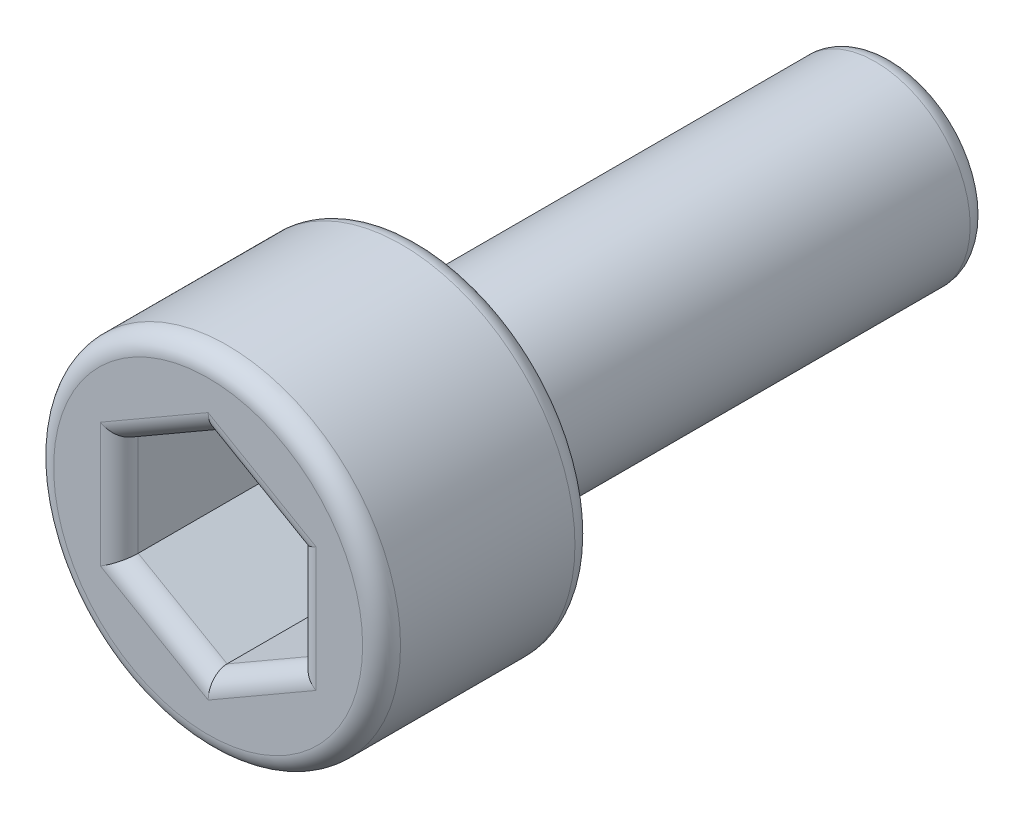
from build123d import *

# Parameters (mm, degrees)
SKETCH1_R          = 1.27
EXTRUDE1_DEPTH     = 6.35
SKETCH2_R          = 2.3241
EXTRUDE2_DEPTH     = 2.8448
CUT_EXTRUDE1_DEPTH = 2.032
FILLET1_R          = 0.254
FILLET2_R          = 0.254
FILLET3_R          = 0.254


with BuildPart() as part:
    # Sketch1 → Extrude1 (new body)
    with BuildSketch(Plane.XY):
        Circle(SKETCH1_R)
    extrude(amount=EXTRUDE1_DEPTH)

    # Sketch2 → Extrude2 (add)
    with BuildSketch(Plane.XY.offset(6.35)):
        Circle(SKETCH2_R)
    extrude(amount=EXTRUDE2_DEPTH)

    # Sketch3 → Cut-Extrude1 (cut)
    with BuildSketch(Plane.XY.offset(9.1948)):
        Polygon((0, -1.374815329), (1.190625, -0.687407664), (1.190625, 0.687407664), (0, 1.374815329), (-1.190625, 0.687407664), (-1.190625, -0.687407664), align=None)
    extrude(amount=-CUT_EXTRUDE1_DEPTH, mode=Mode.SUBTRACT)

    # Fillet1
    fillet1_edges = [part.edges().sort_by_distance(p)[0] for p in [
        (-0.5953125, -1.031111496, 9.1948),
        (0.5953125, -1.031111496, 9.1948),
        (1.190625, 0, 9.1948),
        (0.5953125, 1.031111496, 9.1948),
        (-0.5953125, 1.031111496, 9.1948),
        (-1.190625, 0, 9.1948),
    ]]
    fillet(fillet1_edges, radius=FILLET1_R)

    # Fillet2
    fillet2_edges = [part.edges().sort_by_distance(p)[0] for p in [
        (-2.3241, 0, 6.35),
        (-2.3241, 0, 9.1948),
    ]]
    fillet(fillet2_edges, radius=FILLET2_R)

    # Fillet3
    fillet3_edges = [part.edges().sort_by_distance(p)[0] for p in [
        (-1.27, 0, 0),
    ]]
    fillet(fillet3_edges, radius=FILLET3_R)


solid = part.part
